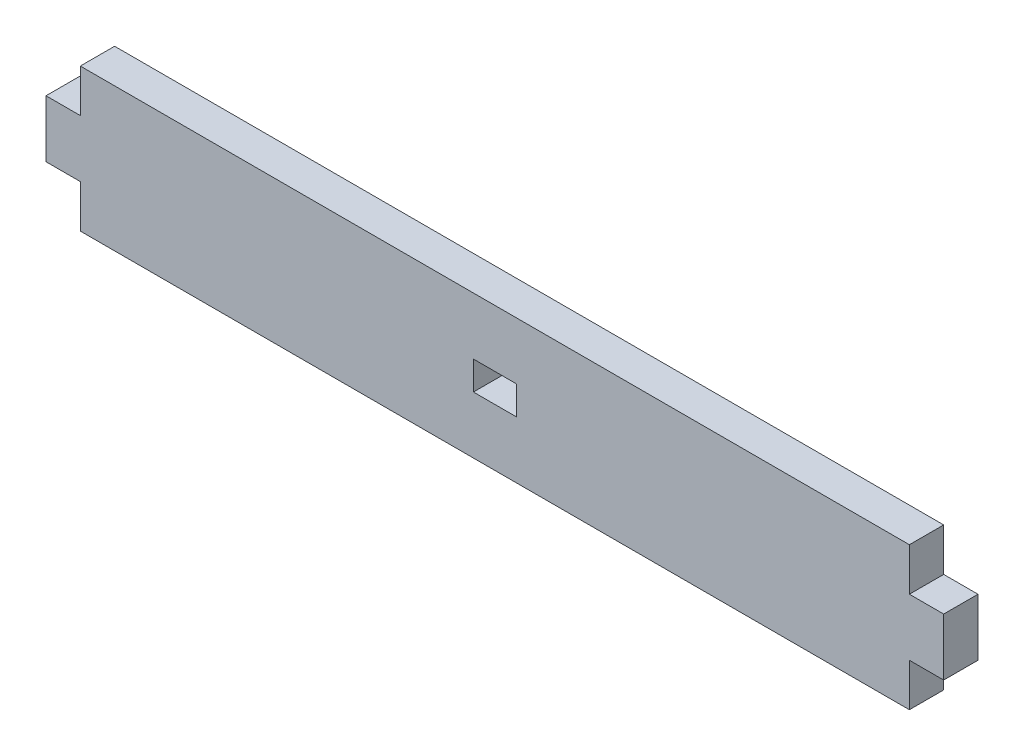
from build123d import *

# Parameters (mm, degrees)
SKETCH1_W           = 15
SKETCH1_H           = 10
BOSS_EXTRUDE1_DEPTH = 12
SKETCH2_R           = 4.7
CUT_EXTRUDE1_DEPTH  = 5


with BuildPart() as part:
    # Sketch1 → Boss-Extrude1 (new body)
    with BuildSketch(Plane.XY):
        Polygon((-145, 25), (-145, 10), (-157, 10), (-157, -10), (-145, -10), (-145, -25), (145, -25), (145, -10), (157, -10), (157, 10), (145, 10), (145, 25), align=None)
        Rectangle(SKETCH1_W, SKETCH1_H, mode=Mode.SUBTRACT)
    extrude(amount=-BOSS_EXTRUDE1_DEPTH)

    # Sketch2 → Cut-Extrude1 (cut)
    with BuildSketch(Plane(origin=(0, 0, -12), x_dir=(-1, 0, 0), z_dir=(0, 0, -1))):
        with Locations((-45, 0)):
            Circle(SKETCH2_R)
        with Locations((45, 0)):
            Circle(SKETCH2_R)
    extrude(amount=-CUT_EXTRUDE1_DEPTH, mode=Mode.SUBTRACT)


solid = part.part
